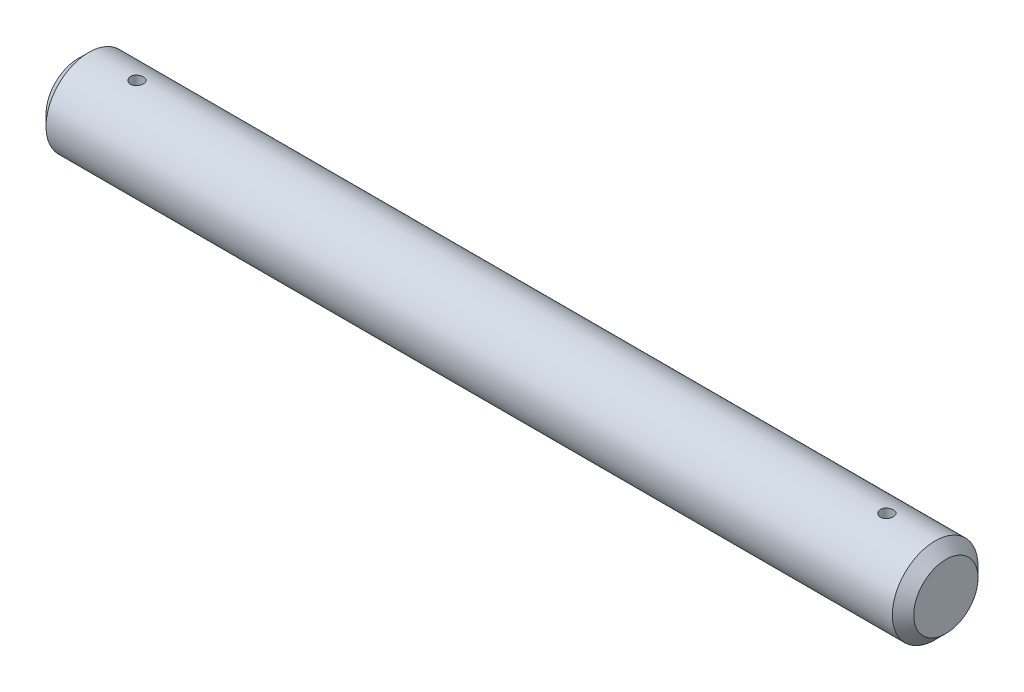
from build123d import *

# Parameters (mm, degrees)
ESQUISSE1_R             = 4
BOSS_EXTRU_1_DEPTH      = 40.5
CHANFREIN1_SIZE         = 1
ESQUISSE2_R             = 0.6
ENL_V_MAT_EXTRU_1_DEPTH = 5


with BuildPart() as part:
    # Esquisse1 → Boss.-Extru.1 (new, symmetric)
    with BuildSketch(Plane(origin=(0, 0, 0), x_dir=(0, 0, -1), z_dir=(1, 0, 0))):
        Circle(ESQUISSE1_R)
    extrude(amount=BOSS_EXTRU_1_DEPTH, both=True)

    # Chanfrein1
    chanfrein1_edges = [part.edges().sort_by_distance(p)[0] for p in [
        (-40.5, 0, 4),
        (40.5, 0, 4),
    ]]
    chamfer(chanfrein1_edges, length=CHANFREIN1_SIZE)

    # Esquisse2 → Enl_v. mat.-Extru.1 (cut, symmetric)
    with BuildSketch(Plane(origin=(0, 0, 0), x_dir=(1, 0, 0), z_dir=(0, 1, 0))):
        with Locations(Location((-35, 0, 0), (0, 0, 270))):
            Circle(ESQUISSE2_R)
        with Locations(Location((35, 0, 0), (0, 0, 270))):
            Circle(ESQUISSE2_R)
    extrude(amount=ENL_V_MAT_EXTRU_1_DEPTH, both=True, mode=Mode.SUBTRACT)


solid = part.part
